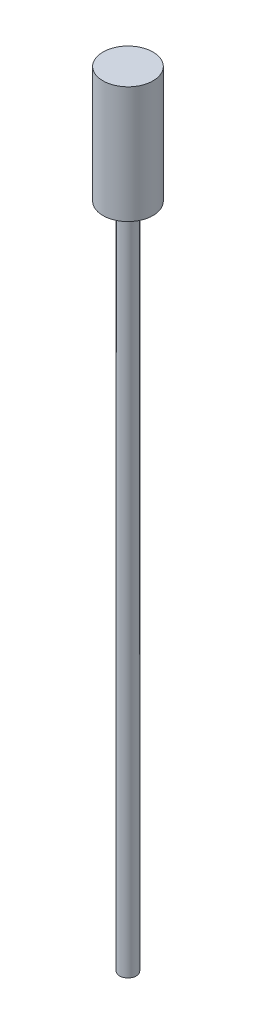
ISO-10303-21;
HEADER;
FILE_DESCRIPTION(('STEP AP214'),'2;1');
FILE_NAME('part.step','',(''),(''),'','','');
FILE_SCHEMA(('AUTOMOTIVE_DESIGN { 1 0 10303 214 1 1 1 1 }'));
ENDSEC;
DATA;
#1=APPLICATION_CONTEXT('core data for automotive mechanical design processes');
#2=APPLICATION_PROTOCOL_DEFINITION('international standard','automotive_design',2000,#1);
#3=PRODUCT_CONTEXT('',#1,'mechanical');
#4=PRODUCT('Part','Part','',(#3));
#5=PRODUCT_RELATED_PRODUCT_CATEGORY('part','',(#4));
#6=PRODUCT_DEFINITION_FORMATION('','',#4);
#7=PRODUCT_DEFINITION_CONTEXT('part definition',#1,'design');
#8=PRODUCT_DEFINITION('design','',#6,#7);
#9=PRODUCT_DEFINITION_SHAPE('','',#8);
#10=(LENGTH_UNIT() NAMED_UNIT(*) SI_UNIT(.MILLI.,.METRE.));
#11=(NAMED_UNIT(*) PLANE_ANGLE_UNIT() SI_UNIT($,.RADIAN.));
#12=(NAMED_UNIT(*) SI_UNIT($,.STERADIAN.) SOLID_ANGLE_UNIT());
#13=UNCERTAINTY_MEASURE_WITH_UNIT(LENGTH_MEASURE(1.E-05),#10,'distance_accuracy_value','');
#14=(GEOMETRIC_REPRESENTATION_CONTEXT(3) GLOBAL_UNCERTAINTY_ASSIGNED_CONTEXT((#13)) GLOBAL_UNIT_ASSIGNED_CONTEXT((#10,
#11,#12)) REPRESENTATION_CONTEXT('',''));
#15=CARTESIAN_POINT('',(0.,0.,0.));
#16=DIRECTION('',(0.,0.,1.));
#17=DIRECTION('',(1.,0.,0.));
#18=AXIS2_PLACEMENT_3D('',#15,#16,#17);
#19=CARTESIAN_POINT('',(0.,14.,0.));
#20=DIRECTION('',(0.,-1.,0.));
#21=DIRECTION('',(0.,0.,-1.));
#22=AXIS2_PLACEMENT_3D('',#19,#20,#21);
#23=CYLINDRICAL_SURFACE('',#22,3.);
#24=CARTESIAN_POINT('',(0.,14.,0.));
#25=DIRECTION('',(0.,1.,0.));
#26=DIRECTION('',(0.,0.,1.));
#27=AXIS2_PLACEMENT_3D('',#24,#25,#26);
#28=CIRCLE('',#27,3.);
#29=CARTESIAN_POINT('',(0.,14.,3.));
#30=VERTEX_POINT('',#29);
#31=EDGE_CURVE('E39',#30,#30,#28,.T.);
#32=ORIENTED_EDGE('',*,*,#31,.F.);
#33=EDGE_LOOP('',(#32));
#34=FACE_BOUND('',#33,.T.);
#35=CARTESIAN_POINT('',(0.,0.,0.));
#36=DIRECTION('',(0.,1.,0.));
#37=DIRECTION('',(0.,0.,1.));
#38=AXIS2_PLACEMENT_3D('',#35,#36,#37);
#39=CIRCLE('',#38,3.);
#40=CARTESIAN_POINT('',(0.,0.,3.));
#41=VERTEX_POINT('',#40);
#42=EDGE_CURVE('E35',#41,#41,#39,.T.);
#43=ORIENTED_EDGE('',*,*,#42,.T.);
#44=EDGE_LOOP('',(#43));
#45=FACE_BOUND('',#44,.T.);
#46=ADVANCED_FACE('F32',(#34,#45),#23,.T.);
#47=CARTESIAN_POINT('',(0.,14.,0.));
#48=DIRECTION('',(0.,1.,0.));
#49=DIRECTION('',(0.,0.,1.));
#50=AXIS2_PLACEMENT_3D('',#47,#48,#49);
#51=PLANE('',#50);
#52=ORIENTED_EDGE('',*,*,#31,.T.);
#53=EDGE_LOOP('',(#52));
#54=FACE_BOUND('',#53,.T.);
#55=ADVANCED_FACE('F56',(#54),#51,.T.);
#56=CARTESIAN_POINT('',(0.,0.,0.));
#57=DIRECTION('',(0.,1.,0.));
#58=DIRECTION('',(0.,0.,1.));
#59=AXIS2_PLACEMENT_3D('',#56,#57,#58);
#60=PLANE('',#59);
#61=CARTESIAN_POINT('',(0.,0.,0.));
#62=DIRECTION('',(0.,-1.,0.));
#63=DIRECTION('',(0.,0.,-1.));
#64=AXIS2_PLACEMENT_3D('',#61,#62,#63);
#65=CIRCLE('',#64,1.);
#66=CARTESIAN_POINT('',(0.,0.,-1.));
#67=VERTEX_POINT('',#66);
#68=EDGE_CURVE('E10',#67,#67,#65,.T.);
#69=ORIENTED_EDGE('',*,*,#68,.F.);
#70=EDGE_LOOP('',(#69));
#71=FACE_BOUND('',#70,.T.);
#72=ORIENTED_EDGE('',*,*,#42,.F.);
#73=EDGE_LOOP('',(#72));
#74=FACE_BOUND('',#73,.T.);
#75=ADVANCED_FACE('F53',(#71,#74),#60,.F.);
#76=CARTESIAN_POINT('',(0.,-80.,0.));
#77=DIRECTION('',(0.,1.,0.));
#78=DIRECTION('',(0.,0.,1.));
#79=AXIS2_PLACEMENT_3D('',#76,#77,#78);
#80=CYLINDRICAL_SURFACE('',#79,1.);
#81=CARTESIAN_POINT('',(0.,-80.,0.));
#82=DIRECTION('',(0.,-1.,0.));
#83=DIRECTION('',(0.,0.,-1.));
#84=AXIS2_PLACEMENT_3D('',#81,#82,#83);
#85=CIRCLE('',#84,1.);
#86=CARTESIAN_POINT('',(0.,-80.,-1.));
#87=VERTEX_POINT('',#86);
#88=EDGE_CURVE('E45',#87,#87,#85,.T.);
#89=ORIENTED_EDGE('',*,*,#88,.F.);
#90=EDGE_LOOP('',(#89));
#91=FACE_BOUND('',#90,.T.);
#92=ORIENTED_EDGE('',*,*,#68,.T.);
#93=EDGE_LOOP('',(#92));
#94=FACE_BOUND('',#93,.T.);
#95=ADVANCED_FACE('F55',(#91,#94),#80,.T.);
#96=CARTESIAN_POINT('',(0.,-80.,0.));
#97=DIRECTION('',(0.,-1.,0.));
#98=DIRECTION('',(0.,0.,-1.));
#99=AXIS2_PLACEMENT_3D('',#96,#97,#98);
#100=PLANE('',#99);
#101=ORIENTED_EDGE('',*,*,#88,.T.);
#102=EDGE_LOOP('',(#101));
#103=FACE_BOUND('',#102,.T.);
#104=ADVANCED_FACE('F62',(#103),#100,.T.);
#105=CLOSED_SHELL('',(#46,#55,#75,#95,#104));
#106=MANIFOLD_SOLID_BREP('B2',#105);
#107=ADVANCED_BREP_SHAPE_REPRESENTATION('',(#18,#106),#14);
#108=SHAPE_DEFINITION_REPRESENTATION(#9,#107);
ENDSEC;
END-ISO-10303-21;
